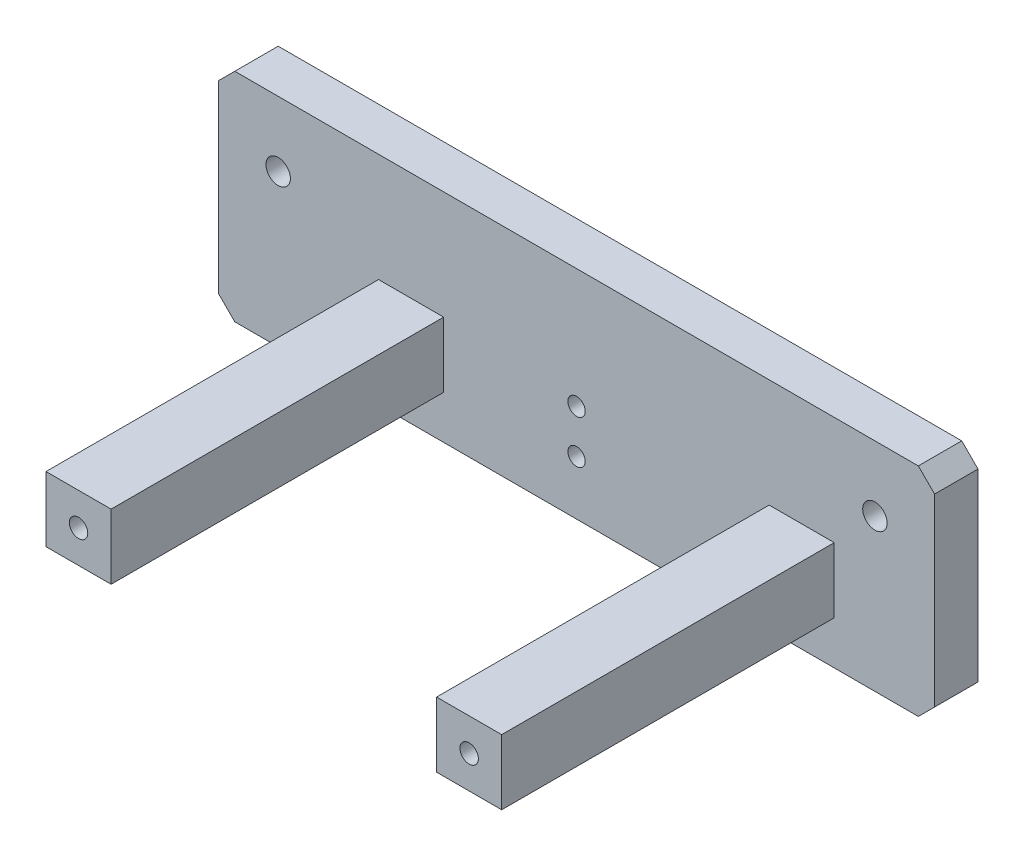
ISO-10303-21;
HEADER;
FILE_DESCRIPTION(('STEP AP214'),'2;1');
FILE_NAME('part.step','',(''),(''),'','','');
FILE_SCHEMA(('AUTOMOTIVE_DESIGN { 1 0 10303 214 1 1 1 1 }'));
ENDSEC;
DATA;
#1=APPLICATION_CONTEXT('core data for automotive mechanical design processes');
#2=APPLICATION_PROTOCOL_DEFINITION('international standard','automotive_design',2000,#1);
#3=PRODUCT_CONTEXT('',#1,'mechanical');
#4=PRODUCT('Part','Part','',(#3));
#5=PRODUCT_RELATED_PRODUCT_CATEGORY('part','',(#4));
#6=PRODUCT_DEFINITION_FORMATION('','',#4);
#7=PRODUCT_DEFINITION_CONTEXT('part definition',#1,'design');
#8=PRODUCT_DEFINITION('design','',#6,#7);
#9=PRODUCT_DEFINITION_SHAPE('','',#8);
#10=(LENGTH_UNIT() NAMED_UNIT(*) SI_UNIT(.MILLI.,.METRE.));
#11=(NAMED_UNIT(*) PLANE_ANGLE_UNIT() SI_UNIT($,.RADIAN.));
#12=(NAMED_UNIT(*) SI_UNIT($,.STERADIAN.) SOLID_ANGLE_UNIT());
#13=UNCERTAINTY_MEASURE_WITH_UNIT(LENGTH_MEASURE(1.E-05),#10,'distance_accuracy_value','');
#14=(GEOMETRIC_REPRESENTATION_CONTEXT(3) GLOBAL_UNCERTAINTY_ASSIGNED_CONTEXT((#13)) GLOBAL_UNIT_ASSIGNED_CONTEXT((#10,
#11,#12)) REPRESENTATION_CONTEXT('',''));
#15=CARTESIAN_POINT('',(0.,0.,0.));
#16=DIRECTION('',(0.,0.,1.));
#17=DIRECTION('',(1.,0.,0.));
#18=AXIS2_PLACEMENT_3D('',#15,#16,#17);
#19=CARTESIAN_POINT('',(0.,0.,8.));
#20=DIRECTION('',(0.,0.,1.));
#21=DIRECTION('',(1.,0.,0.));
#22=AXIS2_PLACEMENT_3D('',#19,#20,#21);
#23=PLANE('',#22);
#24=DIRECTION('',(1.,0.,0.));
#25=VECTOR('',#24,1.);
#26=CARTESIAN_POINT('',(35.5,-12.,8.));
#27=LINE('',#26,#25);
#28=CARTESIAN_POINT('',(35.5,-12.,8.));
#29=VERTEX_POINT('',#28);
#30=CARTESIAN_POINT('',(47.5,-12.,8.));
#31=VERTEX_POINT('',#30);
#32=EDGE_CURVE('E206',#29,#31,#27,.T.);
#33=ORIENTED_EDGE('',*,*,#32,.F.);
#34=DIRECTION('',(0.,-1.,0.));
#35=VECTOR('',#34,1.);
#36=CARTESIAN_POINT('',(35.5,0.,8.));
#37=LINE('',#36,#35);
#38=CARTESIAN_POINT('',(35.5,0.,8.));
#39=VERTEX_POINT('',#38);
#40=EDGE_CURVE('E208',#39,#29,#37,.T.);
#41=ORIENTED_EDGE('',*,*,#40,.F.);
#42=DIRECTION('',(-1.,0.,0.));
#43=VECTOR('',#42,1.);
#44=CARTESIAN_POINT('',(47.5,0.,8.));
#45=LINE('',#44,#43);
#46=CARTESIAN_POINT('',(47.5,0.,8.));
#47=VERTEX_POINT('',#46);
#48=EDGE_CURVE('E201',#47,#39,#45,.T.);
#49=ORIENTED_EDGE('',*,*,#48,.F.);
#50=DIRECTION('',(0.,1.,0.));
#51=VECTOR('',#50,1.);
#52=CARTESIAN_POINT('',(47.5,-12.,8.));
#53=LINE('',#52,#51);
#54=EDGE_CURVE('E203',#31,#47,#53,.T.);
#55=ORIENTED_EDGE('',*,*,#54,.F.);
#56=EDGE_LOOP('',(#33,#41,#49,#55));
#57=FACE_BOUND('',#56,.T.);
#58=CARTESIAN_POINT('',(0.,-10.,8.));
#59=DIRECTION('',(0.,0.,1.));
#60=DIRECTION('',(1.,0.,0.));
#61=AXIS2_PLACEMENT_3D('',#58,#59,#60);
#62=CIRCLE('',#61,1.6);
#63=CARTESIAN_POINT('',(1.6,-10.,8.));
#64=VERTEX_POINT('',#63);
#65=EDGE_CURVE('E225',#64,#64,#62,.T.);
#66=ORIENTED_EDGE('',*,*,#65,.F.);
#67=EDGE_LOOP('',(#66));
#68=FACE_BOUND('',#67,.T.);
#69=CARTESIAN_POINT('',(-55.,8.,8.));
#70=DIRECTION('',(0.,0.,1.));
#71=DIRECTION('',(1.,0.,0.));
#72=AXIS2_PLACEMENT_3D('',#69,#70,#71);
#73=CIRCLE('',#72,2.25);
#74=CARTESIAN_POINT('',(-52.75,8.,8.));
#75=VERTEX_POINT('',#74);
#76=EDGE_CURVE('E243',#75,#75,#73,.T.);
#77=ORIENTED_EDGE('',*,*,#76,.F.);
#78=EDGE_LOOP('',(#77));
#79=FACE_BOUND('',#78,.T.);
#80=DIRECTION('',(0.707106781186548,-0.707106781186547,0.));
#81=VECTOR('',#80,1.);
#82=CARTESIAN_POINT('',(-66.,-17.,8.));
#83=LINE('',#82,#81);
#84=CARTESIAN_POINT('',(-66.,-17.,8.));
#85=VERTEX_POINT('',#84);
#86=CARTESIAN_POINT('',(-63.,-20.,8.));
#87=VERTEX_POINT('',#86);
#88=EDGE_CURVE('E249',#85,#87,#83,.T.);
#89=ORIENTED_EDGE('',*,*,#88,.T.);
#90=DIRECTION('',(1.,0.,0.));
#91=VECTOR('',#90,1.);
#92=CARTESIAN_POINT('',(-63.,-20.,8.));
#93=LINE('',#92,#91);
#94=CARTESIAN_POINT('',(63.,-20.,8.));
#95=VERTEX_POINT('',#94);
#96=EDGE_CURVE('E252',#87,#95,#93,.T.);
#97=ORIENTED_EDGE('',*,*,#96,.T.);
#98=DIRECTION('',(0.707106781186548,0.707106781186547,0.));
#99=VECTOR('',#98,1.);
#100=CARTESIAN_POINT('',(63.,-20.,8.));
#101=LINE('',#100,#99);
#102=CARTESIAN_POINT('',(66.,-17.,8.));
#103=VERTEX_POINT('',#102);
#104=EDGE_CURVE('E255',#95,#103,#101,.T.);
#105=ORIENTED_EDGE('',*,*,#104,.T.);
#106=DIRECTION('',(0.,1.,0.));
#107=VECTOR('',#106,1.);
#108=CARTESIAN_POINT('',(66.,-17.,8.));
#109=LINE('',#108,#107);
#110=CARTESIAN_POINT('',(66.,17.,8.));
#111=VERTEX_POINT('',#110);
#112=EDGE_CURVE('E257',#103,#111,#109,.T.);
#113=ORIENTED_EDGE('',*,*,#112,.T.);
#114=DIRECTION('',(-0.707106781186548,0.707106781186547,0.));
#115=VECTOR('',#114,1.);
#116=CARTESIAN_POINT('',(66.,17.,8.));
#117=LINE('',#116,#115);
#118=CARTESIAN_POINT('',(63.,20.,8.));
#119=VERTEX_POINT('',#118);
#120=EDGE_CURVE('E259',#111,#119,#117,.T.);
#121=ORIENTED_EDGE('',*,*,#120,.T.);
#122=DIRECTION('',(-1.,0.,0.));
#123=VECTOR('',#122,1.);
#124=CARTESIAN_POINT('',(63.,20.,8.));
#125=LINE('',#124,#123);
#126=CARTESIAN_POINT('',(-63.,20.,8.));
#127=VERTEX_POINT('',#126);
#128=EDGE_CURVE('E261',#119,#127,#125,.T.);
#129=ORIENTED_EDGE('',*,*,#128,.T.);
#130=DIRECTION('',(-0.707106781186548,-0.707106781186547,0.));
#131=VECTOR('',#130,1.);
#132=CARTESIAN_POINT('',(-63.,20.,8.));
#133=LINE('',#132,#131);
#134=CARTESIAN_POINT('',(-66.,17.,8.));
#135=VERTEX_POINT('',#134);
#136=EDGE_CURVE('E263',#127,#135,#133,.T.);
#137=ORIENTED_EDGE('',*,*,#136,.T.);
#138=DIRECTION('',(0.,-1.,0.));
#139=VECTOR('',#138,1.);
#140=CARTESIAN_POINT('',(-66.,17.,8.));
#141=LINE('',#140,#139);
#142=EDGE_CURVE('E265',#135,#85,#141,.T.);
#143=ORIENTED_EDGE('',*,*,#142,.T.);
#144=EDGE_LOOP('',(#89,#97,#105,#113,#121,#129,#137,#143));
#145=FACE_BOUND('',#144,.T.);
#146=CARTESIAN_POINT('',(55.,8.,8.));
#147=DIRECTION('',(0.,0.,1.));
#148=DIRECTION('',(1.,0.,0.));
#149=AXIS2_PLACEMENT_3D('',#146,#147,#148);
#150=CIRCLE('',#149,2.25);
#151=CARTESIAN_POINT('',(57.25,8.,8.));
#152=VERTEX_POINT('',#151);
#153=EDGE_CURVE('E237',#152,#152,#150,.T.);
#154=ORIENTED_EDGE('',*,*,#153,.F.);
#155=EDGE_LOOP('',(#154));
#156=FACE_BOUND('',#155,.T.);
#157=CARTESIAN_POINT('',(0.,-2.,8.));
#158=DIRECTION('',(0.,0.,1.));
#159=DIRECTION('',(1.,0.,0.));
#160=AXIS2_PLACEMENT_3D('',#157,#158,#159);
#161=CIRCLE('',#160,1.6);
#162=CARTESIAN_POINT('',(1.6,-2.,8.));
#163=VERTEX_POINT('',#162);
#164=EDGE_CURVE('E186',#163,#163,#161,.T.);
#165=ORIENTED_EDGE('',*,*,#164,.F.);
#166=EDGE_LOOP('',(#165));
#167=FACE_BOUND('',#166,.T.);
#168=DIRECTION('',(1.,0.,0.));
#169=VECTOR('',#168,1.);
#170=CARTESIAN_POINT('',(-36.5,-12.,8.));
#171=LINE('',#170,#169);
#172=CARTESIAN_POINT('',(-36.5,-12.,8.));
#173=VERTEX_POINT('',#172);
#174=CARTESIAN_POINT('',(-24.5,-12.,8.));
#175=VERTEX_POINT('',#174);
#176=EDGE_CURVE('E417',#173,#175,#171,.T.);
#177=ORIENTED_EDGE('',*,*,#176,.F.);
#178=DIRECTION('',(0.,-1.,0.));
#179=VECTOR('',#178,1.);
#180=CARTESIAN_POINT('',(-36.5,0.,8.));
#181=LINE('',#180,#179);
#182=CARTESIAN_POINT('',(-36.5,0.,8.));
#183=VERTEX_POINT('',#182);
#184=EDGE_CURVE('E181',#183,#173,#181,.T.);
#185=ORIENTED_EDGE('',*,*,#184,.F.);
#186=DIRECTION('',(-1.,0.,0.));
#187=VECTOR('',#186,1.);
#188=CARTESIAN_POINT('',(-24.5,0.,8.));
#189=LINE('',#188,#187);
#190=CARTESIAN_POINT('',(-24.5,0.,8.));
#191=VERTEX_POINT('',#190);
#192=EDGE_CURVE('E177',#191,#183,#189,.T.);
#193=ORIENTED_EDGE('',*,*,#192,.F.);
#194=DIRECTION('',(0.,1.,0.));
#195=VECTOR('',#194,1.);
#196=CARTESIAN_POINT('',(-24.5,-12.,8.));
#197=LINE('',#196,#195);
#198=EDGE_CURVE('E424',#175,#191,#197,.T.);
#199=ORIENTED_EDGE('',*,*,#198,.F.);
#200=EDGE_LOOP('',(#177,#185,#193,#199));
#201=FACE_BOUND('',#200,.T.);
#202=ADVANCED_FACE('F43',(#57,#68,#79,#145,#156,#167,#201),#23,.T.);
#203=CARTESIAN_POINT('',(0.,0.,0.));
#204=DIRECTION('',(0.,0.,1.));
#205=DIRECTION('',(1.,0.,0.));
#206=AXIS2_PLACEMENT_3D('',#203,#204,#205);
#207=PLANE('',#206);
#208=DIRECTION('',(0.707106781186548,-0.707106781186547,0.));
#209=VECTOR('',#208,1.);
#210=CARTESIAN_POINT('',(-66.,-17.,0.));
#211=LINE('',#210,#209);
#212=CARTESIAN_POINT('',(-66.,-17.,0.));
#213=VERTEX_POINT('',#212);
#214=CARTESIAN_POINT('',(-63.,-20.,0.));
#215=VERTEX_POINT('',#214);
#216=EDGE_CURVE('E246',#213,#215,#211,.T.);
#217=ORIENTED_EDGE('',*,*,#216,.F.);
#218=DIRECTION('',(0.,-1.,0.));
#219=VECTOR('',#218,1.);
#220=CARTESIAN_POINT('',(-66.,17.,0.));
#221=LINE('',#220,#219);
#222=CARTESIAN_POINT('',(-66.,17.,0.));
#223=VERTEX_POINT('',#222);
#224=EDGE_CURVE('E253',#223,#213,#221,.T.);
#225=ORIENTED_EDGE('',*,*,#224,.F.);
#226=DIRECTION('',(-0.707106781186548,-0.707106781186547,0.));
#227=VECTOR('',#226,1.);
#228=CARTESIAN_POINT('',(-63.,20.,0.));
#229=LINE('',#228,#227);
#230=CARTESIAN_POINT('',(-63.,20.,0.));
#231=VERTEX_POINT('',#230);
#232=EDGE_CURVE('E280',#231,#223,#229,.T.);
#233=ORIENTED_EDGE('',*,*,#232,.F.);
#234=DIRECTION('',(-1.,0.,0.));
#235=VECTOR('',#234,1.);
#236=CARTESIAN_POINT('',(63.,20.,0.));
#237=LINE('',#236,#235);
#238=CARTESIAN_POINT('',(63.,20.,0.));
#239=VERTEX_POINT('',#238);
#240=EDGE_CURVE('E278',#239,#231,#237,.T.);
#241=ORIENTED_EDGE('',*,*,#240,.F.);
#242=DIRECTION('',(-0.707106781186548,0.707106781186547,0.));
#243=VECTOR('',#242,1.);
#244=CARTESIAN_POINT('',(66.,17.,0.));
#245=LINE('',#244,#243);
#246=CARTESIAN_POINT('',(66.,17.,0.));
#247=VERTEX_POINT('',#246);
#248=EDGE_CURVE('E276',#247,#239,#245,.T.);
#249=ORIENTED_EDGE('',*,*,#248,.F.);
#250=DIRECTION('',(0.,1.,0.));
#251=VECTOR('',#250,1.);
#252=CARTESIAN_POINT('',(66.,-17.,0.));
#253=LINE('',#252,#251);
#254=CARTESIAN_POINT('',(66.,-17.,0.));
#255=VERTEX_POINT('',#254);
#256=EDGE_CURVE('E274',#255,#247,#253,.T.);
#257=ORIENTED_EDGE('',*,*,#256,.F.);
#258=DIRECTION('',(0.707106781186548,0.707106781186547,0.));
#259=VECTOR('',#258,1.);
#260=CARTESIAN_POINT('',(63.,-20.,0.));
#261=LINE('',#260,#259);
#262=CARTESIAN_POINT('',(63.,-20.,0.));
#263=VERTEX_POINT('',#262);
#264=EDGE_CURVE('E272',#263,#255,#261,.T.);
#265=ORIENTED_EDGE('',*,*,#264,.F.);
#266=DIRECTION('',(1.,0.,0.));
#267=VECTOR('',#266,1.);
#268=CARTESIAN_POINT('',(-63.,-20.,0.));
#269=LINE('',#268,#267);
#270=EDGE_CURVE('E270',#215,#263,#269,.T.);
#271=ORIENTED_EDGE('',*,*,#270,.F.);
#272=EDGE_LOOP('',(#217,#225,#233,#241,#249,#257,#265,#271));
#273=FACE_BOUND('',#272,.T.);
#274=CARTESIAN_POINT('',(-55.,8.,0.));
#275=DIRECTION('',(0.,0.,1.));
#276=DIRECTION('',(1.,0.,0.));
#277=AXIS2_PLACEMENT_3D('',#274,#275,#276);
#278=CIRCLE('',#277,2.25);
#279=CARTESIAN_POINT('',(-52.75,8.,0.));
#280=VERTEX_POINT('',#279);
#281=EDGE_CURVE('E240',#280,#280,#278,.T.);
#282=ORIENTED_EDGE('',*,*,#281,.T.);
#283=EDGE_LOOP('',(#282));
#284=FACE_BOUND('',#283,.T.);
#285=CARTESIAN_POINT('',(55.,8.,0.));
#286=DIRECTION('',(0.,0.,1.));
#287=DIRECTION('',(1.,0.,0.));
#288=AXIS2_PLACEMENT_3D('',#285,#286,#287);
#289=CIRCLE('',#288,2.25);
#290=CARTESIAN_POINT('',(57.25,8.,0.));
#291=VERTEX_POINT('',#290);
#292=EDGE_CURVE('E236',#291,#291,#289,.T.);
#293=ORIENTED_EDGE('',*,*,#292,.T.);
#294=EDGE_LOOP('',(#293));
#295=FACE_BOUND('',#294,.T.);
#296=CARTESIAN_POINT('',(-30.5,-6.,0.));
#297=DIRECTION('',(0.,0.,1.));
#298=DIRECTION('',(1.,0.,0.));
#299=AXIS2_PLACEMENT_3D('',#296,#297,#298);
#300=CIRCLE('',#299,1.7);
#301=CARTESIAN_POINT('',(-28.8,-6.,0.));
#302=VERTEX_POINT('',#301);
#303=EDGE_CURVE('E233',#302,#302,#300,.T.);
#304=ORIENTED_EDGE('',*,*,#303,.T.);
#305=EDGE_LOOP('',(#304));
#306=FACE_BOUND('',#305,.T.);
#307=CARTESIAN_POINT('',(41.5,-6.,0.));
#308=DIRECTION('',(0.,0.,1.));
#309=DIRECTION('',(1.,0.,0.));
#310=AXIS2_PLACEMENT_3D('',#307,#308,#309);
#311=CIRCLE('',#310,1.7);
#312=CARTESIAN_POINT('',(43.2,-6.,0.));
#313=VERTEX_POINT('',#312);
#314=EDGE_CURVE('E228',#313,#313,#311,.T.);
#315=ORIENTED_EDGE('',*,*,#314,.T.);
#316=EDGE_LOOP('',(#315));
#317=FACE_BOUND('',#316,.T.);
#318=CARTESIAN_POINT('',(0.,-10.,0.));
#319=DIRECTION('',(0.,0.,1.));
#320=DIRECTION('',(1.,0.,0.));
#321=AXIS2_PLACEMENT_3D('',#318,#319,#320);
#322=CIRCLE('',#321,1.6);
#323=CARTESIAN_POINT('',(1.6,-10.,0.));
#324=VERTEX_POINT('',#323);
#325=EDGE_CURVE('E223',#324,#324,#322,.T.);
#326=ORIENTED_EDGE('',*,*,#325,.T.);
#327=EDGE_LOOP('',(#326));
#328=FACE_BOUND('',#327,.T.);
#329=CARTESIAN_POINT('',(0.,-2.,0.));
#330=DIRECTION('',(0.,0.,1.));
#331=DIRECTION('',(1.,0.,0.));
#332=AXIS2_PLACEMENT_3D('',#329,#330,#331);
#333=CIRCLE('',#332,1.6);
#334=CARTESIAN_POINT('',(1.6,-2.,0.));
#335=VERTEX_POINT('',#334);
#336=EDGE_CURVE('E183',#335,#335,#333,.T.);
#337=ORIENTED_EDGE('',*,*,#336,.T.);
#338=EDGE_LOOP('',(#337));
#339=FACE_BOUND('',#338,.T.);
#340=ADVANCED_FACE('F310',(#273,#284,#295,#306,#317,#328,#339),#207,.F.);
#341=CARTESIAN_POINT('',(-66.,-17.,8.));
#342=DIRECTION('',(0.707106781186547,0.707106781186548,0.));
#343=DIRECTION('',(-0.707106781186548,0.707106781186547,0.));
#344=AXIS2_PLACEMENT_3D('',#341,#342,#343);
#345=PLANE('',#344);
#346=ORIENTED_EDGE('',*,*,#216,.T.);
#347=DIRECTION('',(0.,0.,-1.));
#348=VECTOR('',#347,1.);
#349=CARTESIAN_POINT('',(-63.,-20.,8.));
#350=LINE('',#349,#348);
#351=EDGE_CURVE('E11',#87,#215,#350,.T.);
#352=ORIENTED_EDGE('',*,*,#351,.F.);
#353=ORIENTED_EDGE('',*,*,#88,.F.);
#354=DIRECTION('',(0.,0.,-1.));
#355=VECTOR('',#354,1.);
#356=CARTESIAN_POINT('',(-66.,-17.,8.));
#357=LINE('',#356,#355);
#358=EDGE_CURVE('E267',#85,#213,#357,.T.);
#359=ORIENTED_EDGE('',*,*,#358,.T.);
#360=EDGE_LOOP('',(#346,#352,#353,#359));
#361=FACE_BOUND('',#360,.T.);
#362=ADVANCED_FACE('F45',(#361),#345,.F.);
#363=CARTESIAN_POINT('',(-63.,-20.,8.));
#364=DIRECTION('',(0.,1.,0.));
#365=DIRECTION('',(0.,0.,1.));
#366=AXIS2_PLACEMENT_3D('',#363,#364,#365);
#367=PLANE('',#366);
#368=ORIENTED_EDGE('',*,*,#270,.T.);
#369=DIRECTION('',(0.,0.,-1.));
#370=VECTOR('',#369,1.);
#371=CARTESIAN_POINT('',(63.,-20.,8.));
#372=LINE('',#371,#370);
#373=EDGE_CURVE('E51',#95,#263,#372,.T.);
#374=ORIENTED_EDGE('',*,*,#373,.F.);
#375=ORIENTED_EDGE('',*,*,#96,.F.);
#376=ORIENTED_EDGE('',*,*,#351,.T.);
#377=EDGE_LOOP('',(#368,#374,#375,#376));
#378=FACE_BOUND('',#377,.T.);
#379=ADVANCED_FACE('F328',(#378),#367,.F.);
#380=CARTESIAN_POINT('',(63.,-20.,8.));
#381=DIRECTION('',(-0.707106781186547,0.707106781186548,0.));
#382=DIRECTION('',(-0.707106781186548,-0.707106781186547,0.));
#383=AXIS2_PLACEMENT_3D('',#380,#381,#382);
#384=PLANE('',#383);
#385=ORIENTED_EDGE('',*,*,#264,.T.);
#386=DIRECTION('',(0.,0.,-1.));
#387=VECTOR('',#386,1.);
#388=CARTESIAN_POINT('',(66.,-17.,8.));
#389=LINE('',#388,#387);
#390=EDGE_CURVE('E297',#103,#255,#389,.T.);
#391=ORIENTED_EDGE('',*,*,#390,.F.);
#392=ORIENTED_EDGE('',*,*,#104,.F.);
#393=ORIENTED_EDGE('',*,*,#373,.T.);
#394=EDGE_LOOP('',(#385,#391,#392,#393));
#395=FACE_BOUND('',#394,.T.);
#396=ADVANCED_FACE('F304',(#395),#384,.F.);
#397=CARTESIAN_POINT('',(66.,-17.,8.));
#398=DIRECTION('',(-1.,0.,0.));
#399=DIRECTION('',(0.,0.,1.));
#400=AXIS2_PLACEMENT_3D('',#397,#398,#399);
#401=PLANE('',#400);
#402=ORIENTED_EDGE('',*,*,#256,.T.);
#403=DIRECTION('',(0.,0.,-1.));
#404=VECTOR('',#403,1.);
#405=CARTESIAN_POINT('',(66.,17.,8.));
#406=LINE('',#405,#404);
#407=EDGE_CURVE('E294',#111,#247,#406,.T.);
#408=ORIENTED_EDGE('',*,*,#407,.F.);
#409=ORIENTED_EDGE('',*,*,#112,.F.);
#410=ORIENTED_EDGE('',*,*,#390,.T.);
#411=EDGE_LOOP('',(#402,#408,#409,#410));
#412=FACE_BOUND('',#411,.T.);
#413=ADVANCED_FACE('F316',(#412),#401,.F.);
#414=CARTESIAN_POINT('',(66.,17.,8.));
#415=DIRECTION('',(-0.707106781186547,-0.707106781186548,0.));
#416=DIRECTION('',(0.707106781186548,-0.707106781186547,0.));
#417=AXIS2_PLACEMENT_3D('',#414,#415,#416);
#418=PLANE('',#417);
#419=ORIENTED_EDGE('',*,*,#248,.T.);
#420=DIRECTION('',(0.,0.,-1.));
#421=VECTOR('',#420,1.);
#422=CARTESIAN_POINT('',(63.,20.,8.));
#423=LINE('',#422,#421);
#424=EDGE_CURVE('E291',#119,#239,#423,.T.);
#425=ORIENTED_EDGE('',*,*,#424,.F.);
#426=ORIENTED_EDGE('',*,*,#120,.F.);
#427=ORIENTED_EDGE('',*,*,#407,.T.);
#428=EDGE_LOOP('',(#419,#425,#426,#427));
#429=FACE_BOUND('',#428,.T.);
#430=ADVANCED_FACE('F320',(#429),#418,.F.);
#431=CARTESIAN_POINT('',(63.,20.,8.));
#432=DIRECTION('',(0.,-1.,0.));
#433=DIRECTION('',(0.,0.,-1.));
#434=AXIS2_PLACEMENT_3D('',#431,#432,#433);
#435=PLANE('',#434);
#436=ORIENTED_EDGE('',*,*,#240,.T.);
#437=DIRECTION('',(0.,0.,-1.));
#438=VECTOR('',#437,1.);
#439=CARTESIAN_POINT('',(-63.,20.,8.));
#440=LINE('',#439,#438);
#441=EDGE_CURVE('E288',#127,#231,#440,.T.);
#442=ORIENTED_EDGE('',*,*,#441,.F.);
#443=ORIENTED_EDGE('',*,*,#128,.F.);
#444=ORIENTED_EDGE('',*,*,#424,.T.);
#445=EDGE_LOOP('',(#436,#442,#443,#444));
#446=FACE_BOUND('',#445,.T.);
#447=ADVANCED_FACE('F341',(#446),#435,.F.);
#448=CARTESIAN_POINT('',(-63.,20.,8.));
#449=DIRECTION('',(0.707106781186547,-0.707106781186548,0.));
#450=DIRECTION('',(0.707106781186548,0.707106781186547,0.));
#451=AXIS2_PLACEMENT_3D('',#448,#449,#450);
#452=PLANE('',#451);
#453=ORIENTED_EDGE('',*,*,#232,.T.);
#454=DIRECTION('',(0.,0.,-1.));
#455=VECTOR('',#454,1.);
#456=CARTESIAN_POINT('',(-66.,17.,8.));
#457=LINE('',#456,#455);
#458=EDGE_CURVE('E285',#135,#223,#457,.T.);
#459=ORIENTED_EDGE('',*,*,#458,.F.);
#460=ORIENTED_EDGE('',*,*,#136,.F.);
#461=ORIENTED_EDGE('',*,*,#441,.T.);
#462=EDGE_LOOP('',(#453,#459,#460,#461));
#463=FACE_BOUND('',#462,.T.);
#464=ADVANCED_FACE('F339',(#463),#452,.F.);
#465=CARTESIAN_POINT('',(-66.,17.,8.));
#466=DIRECTION('',(1.,0.,0.));
#467=DIRECTION('',(0.,0.,-1.));
#468=AXIS2_PLACEMENT_3D('',#465,#466,#467);
#469=PLANE('',#468);
#470=ORIENTED_EDGE('',*,*,#224,.T.);
#471=ORIENTED_EDGE('',*,*,#358,.F.);
#472=ORIENTED_EDGE('',*,*,#142,.F.);
#473=ORIENTED_EDGE('',*,*,#458,.T.);
#474=EDGE_LOOP('',(#470,#471,#472,#473));
#475=FACE_BOUND('',#474,.T.);
#476=ADVANCED_FACE('F334',(#475),#469,.F.);
#477=CARTESIAN_POINT('',(-55.,8.,8.));
#478=DIRECTION('',(0.,0.,-1.));
#479=DIRECTION('',(-1.,0.,0.));
#480=AXIS2_PLACEMENT_3D('',#477,#478,#479);
#481=CYLINDRICAL_SURFACE('',#480,2.25);
#482=ORIENTED_EDGE('',*,*,#76,.T.);
#483=EDGE_LOOP('',(#482));
#484=FACE_BOUND('',#483,.T.);
#485=ORIENTED_EDGE('',*,*,#281,.F.);
#486=EDGE_LOOP('',(#485));
#487=FACE_BOUND('',#486,.T.);
#488=ADVANCED_FACE('F362',(#484,#487),#481,.F.);
#489=CARTESIAN_POINT('',(55.,8.,8.));
#490=DIRECTION('',(0.,0.,-1.));
#491=DIRECTION('',(-1.,0.,0.));
#492=AXIS2_PLACEMENT_3D('',#489,#490,#491);
#493=CYLINDRICAL_SURFACE('',#492,2.25);
#494=ORIENTED_EDGE('',*,*,#153,.T.);
#495=EDGE_LOOP('',(#494));
#496=FACE_BOUND('',#495,.T.);
#497=ORIENTED_EDGE('',*,*,#292,.F.);
#498=EDGE_LOOP('',(#497));
#499=FACE_BOUND('',#498,.T.);
#500=ADVANCED_FACE('F369',(#496,#499),#493,.F.);
#501=CARTESIAN_POINT('',(-30.5,-6.,8.));
#502=DIRECTION('',(0.,0.,-1.));
#503=DIRECTION('',(-1.,0.,0.));
#504=AXIS2_PLACEMENT_3D('',#501,#502,#503);
#505=CYLINDRICAL_SURFACE('',#504,1.7);
#506=ORIENTED_EDGE('',*,*,#303,.F.);
#507=EDGE_LOOP('',(#506));
#508=FACE_BOUND('',#507,.T.);
#509=CARTESIAN_POINT('',(-30.5,-6.,69.3));
#510=DIRECTION('',(0.,0.,1.));
#511=DIRECTION('',(1.,0.,0.));
#512=AXIS2_PLACEMENT_3D('',#509,#510,#511);
#513=CIRCLE('',#512,1.7);
#514=CARTESIAN_POINT('',(-28.8,-6.,69.3));
#515=VERTEX_POINT('',#514);
#516=EDGE_CURVE('E221',#515,#515,#513,.T.);
#517=ORIENTED_EDGE('',*,*,#516,.T.);
#518=EDGE_LOOP('',(#517));
#519=FACE_BOUND('',#518,.T.);
#520=ADVANCED_FACE('F374',(#508,#519),#505,.F.);
#521=CARTESIAN_POINT('',(41.5,-6.,8.));
#522=DIRECTION('',(0.,0.,-1.));
#523=DIRECTION('',(-1.,0.,0.));
#524=AXIS2_PLACEMENT_3D('',#521,#522,#523);
#525=CYLINDRICAL_SURFACE('',#524,1.7);
#526=ORIENTED_EDGE('',*,*,#314,.F.);
#527=EDGE_LOOP('',(#526));
#528=FACE_BOUND('',#527,.T.);
#529=CARTESIAN_POINT('',(41.5,-6.,69.3));
#530=DIRECTION('',(0.,0.,1.));
#531=DIRECTION('',(1.,0.,0.));
#532=AXIS2_PLACEMENT_3D('',#529,#530,#531);
#533=CIRCLE('',#532,1.7);
#534=CARTESIAN_POINT('',(43.2,-6.,69.3));
#535=VERTEX_POINT('',#534);
#536=EDGE_CURVE('E211',#535,#535,#533,.T.);
#537=ORIENTED_EDGE('',*,*,#536,.T.);
#538=EDGE_LOOP('',(#537));
#539=FACE_BOUND('',#538,.T.);
#540=ADVANCED_FACE('F402',(#528,#539),#525,.F.);
#541=CARTESIAN_POINT('',(0.,-10.,8.));
#542=DIRECTION('',(0.,0.,-1.));
#543=DIRECTION('',(-1.,0.,0.));
#544=AXIS2_PLACEMENT_3D('',#541,#542,#543);
#545=CYLINDRICAL_SURFACE('',#544,1.6);
#546=ORIENTED_EDGE('',*,*,#65,.T.);
#547=EDGE_LOOP('',(#546));
#548=FACE_BOUND('',#547,.T.);
#549=ORIENTED_EDGE('',*,*,#325,.F.);
#550=EDGE_LOOP('',(#549));
#551=FACE_BOUND('',#550,.T.);
#552=ADVANCED_FACE('F392',(#548,#551),#545,.F.);
#553=CARTESIAN_POINT('',(0.,-2.,8.));
#554=DIRECTION('',(0.,0.,-1.));
#555=DIRECTION('',(-1.,0.,0.));
#556=AXIS2_PLACEMENT_3D('',#553,#554,#555);
#557=CYLINDRICAL_SURFACE('',#556,1.6);
#558=ORIENTED_EDGE('',*,*,#164,.T.);
#559=EDGE_LOOP('',(#558));
#560=FACE_BOUND('',#559,.T.);
#561=ORIENTED_EDGE('',*,*,#336,.F.);
#562=EDGE_LOOP('',(#561));
#563=FACE_BOUND('',#562,.T.);
#564=ADVANCED_FACE('F390',(#560,#563),#557,.F.);
#565=CARTESIAN_POINT('',(0.,0.,69.3));
#566=DIRECTION('',(0.,0.,1.));
#567=DIRECTION('',(1.,0.,0.));
#568=AXIS2_PLACEMENT_3D('',#565,#566,#567);
#569=PLANE('',#568);
#570=DIRECTION('',(0.,-1.,0.));
#571=VECTOR('',#570,1.);
#572=CARTESIAN_POINT('',(35.5,0.,69.3));
#573=LINE('',#572,#571);
#574=CARTESIAN_POINT('',(35.5,0.,69.3));
#575=VERTEX_POINT('',#574);
#576=CARTESIAN_POINT('',(35.5,-12.,69.3));
#577=VERTEX_POINT('',#576);
#578=EDGE_CURVE('E204',#575,#577,#573,.T.);
#579=ORIENTED_EDGE('',*,*,#578,.T.);
#580=DIRECTION('',(1.,0.,0.));
#581=VECTOR('',#580,1.);
#582=CARTESIAN_POINT('',(35.5,-12.,69.3));
#583=LINE('',#582,#581);
#584=CARTESIAN_POINT('',(47.5,-12.,69.3));
#585=VERTEX_POINT('',#584);
#586=EDGE_CURVE('E215',#577,#585,#583,.T.);
#587=ORIENTED_EDGE('',*,*,#586,.T.);
#588=DIRECTION('',(0.,1.,0.));
#589=VECTOR('',#588,1.);
#590=CARTESIAN_POINT('',(47.5,-12.,69.3));
#591=LINE('',#590,#589);
#592=CARTESIAN_POINT('',(47.5,0.,69.3));
#593=VERTEX_POINT('',#592);
#594=EDGE_CURVE('E213',#585,#593,#591,.T.);
#595=ORIENTED_EDGE('',*,*,#594,.T.);
#596=DIRECTION('',(-1.,0.,0.));
#597=VECTOR('',#596,1.);
#598=CARTESIAN_POINT('',(47.5,0.,69.3));
#599=LINE('',#598,#597);
#600=EDGE_CURVE('E200',#593,#575,#599,.T.);
#601=ORIENTED_EDGE('',*,*,#600,.T.);
#602=EDGE_LOOP('',(#579,#587,#595,#601));
#603=FACE_BOUND('',#602,.T.);
#604=ORIENTED_EDGE('',*,*,#536,.F.);
#605=EDGE_LOOP('',(#604));
#606=FACE_BOUND('',#605,.T.);
#607=ADVANCED_FACE('F391',(#603,#606),#569,.T.);
#608=CARTESIAN_POINT('',(35.5,0.,69.3));
#609=DIRECTION('',(1.,0.,0.));
#610=DIRECTION('',(0.,0.,-1.));
#611=AXIS2_PLACEMENT_3D('',#608,#609,#610);
#612=PLANE('',#611);
#613=ORIENTED_EDGE('',*,*,#40,.T.);
#614=DIRECTION('',(0.,0.,-1.));
#615=VECTOR('',#614,1.);
#616=CARTESIAN_POINT('',(35.5,-12.,69.3));
#617=LINE('',#616,#615);
#618=EDGE_CURVE('E191',#577,#29,#617,.T.);
#619=ORIENTED_EDGE('',*,*,#618,.F.);
#620=ORIENTED_EDGE('',*,*,#578,.F.);
#621=DIRECTION('',(0.,0.,-1.));
#622=VECTOR('',#621,1.);
#623=CARTESIAN_POINT('',(35.5,0.,69.3));
#624=LINE('',#623,#622);
#625=EDGE_CURVE('E197',#575,#39,#624,.T.);
#626=ORIENTED_EDGE('',*,*,#625,.T.);
#627=EDGE_LOOP('',(#613,#619,#620,#626));
#628=FACE_BOUND('',#627,.T.);
#629=ADVANCED_FACE('F399',(#628),#612,.F.);
#630=CARTESIAN_POINT('',(35.5,-12.,69.3));
#631=DIRECTION('',(0.,1.,0.));
#632=DIRECTION('',(0.,0.,1.));
#633=AXIS2_PLACEMENT_3D('',#630,#631,#632);
#634=PLANE('',#633);
#635=ORIENTED_EDGE('',*,*,#32,.T.);
#636=DIRECTION('',(0.,0.,-1.));
#637=VECTOR('',#636,1.);
#638=CARTESIAN_POINT('',(47.5,-12.,69.3));
#639=LINE('',#638,#637);
#640=EDGE_CURVE('E193',#585,#31,#639,.T.);
#641=ORIENTED_EDGE('',*,*,#640,.F.);
#642=ORIENTED_EDGE('',*,*,#586,.F.);
#643=ORIENTED_EDGE('',*,*,#618,.T.);
#644=EDGE_LOOP('',(#635,#641,#642,#643));
#645=FACE_BOUND('',#644,.T.);
#646=ADVANCED_FACE('F447',(#645),#634,.F.);
#647=CARTESIAN_POINT('',(47.5,-12.,69.3));
#648=DIRECTION('',(-1.,0.,0.));
#649=DIRECTION('',(0.,0.,1.));
#650=AXIS2_PLACEMENT_3D('',#647,#648,#649);
#651=PLANE('',#650);
#652=ORIENTED_EDGE('',*,*,#54,.T.);
#653=DIRECTION('',(0.,0.,-1.));
#654=VECTOR('',#653,1.);
#655=CARTESIAN_POINT('',(47.5,0.,69.3));
#656=LINE('',#655,#654);
#657=EDGE_CURVE('E66',#593,#47,#656,.T.);
#658=ORIENTED_EDGE('',*,*,#657,.F.);
#659=ORIENTED_EDGE('',*,*,#594,.F.);
#660=ORIENTED_EDGE('',*,*,#640,.T.);
#661=EDGE_LOOP('',(#652,#658,#659,#660));
#662=FACE_BOUND('',#661,.T.);
#663=ADVANCED_FACE('F451',(#662),#651,.F.);
#664=CARTESIAN_POINT('',(47.5,0.,69.3));
#665=DIRECTION('',(0.,-1.,0.));
#666=DIRECTION('',(0.,0.,-1.));
#667=AXIS2_PLACEMENT_3D('',#664,#665,#666);
#668=PLANE('',#667);
#669=ORIENTED_EDGE('',*,*,#48,.T.);
#670=ORIENTED_EDGE('',*,*,#625,.F.);
#671=ORIENTED_EDGE('',*,*,#600,.F.);
#672=ORIENTED_EDGE('',*,*,#657,.T.);
#673=EDGE_LOOP('',(#669,#670,#671,#672));
#674=FACE_BOUND('',#673,.T.);
#675=ADVANCED_FACE('F454',(#674),#668,.F.);
#676=CARTESIAN_POINT('',(0.,0.,69.3));
#677=DIRECTION('',(0.,0.,1.));
#678=DIRECTION('',(1.,0.,0.));
#679=AXIS2_PLACEMENT_3D('',#676,#677,#678);
#680=PLANE('',#679);
#681=DIRECTION('',(0.,-1.,0.));
#682=VECTOR('',#681,1.);
#683=CARTESIAN_POINT('',(-36.5,0.,69.3));
#684=LINE('',#683,#682);
#685=CARTESIAN_POINT('',(-36.5,0.,69.3));
#686=VERTEX_POINT('',#685);
#687=CARTESIAN_POINT('',(-36.5,-12.,69.3));
#688=VERTEX_POINT('',#687);
#689=EDGE_CURVE('E168',#686,#688,#684,.T.);
#690=ORIENTED_EDGE('',*,*,#689,.T.);
#691=DIRECTION('',(1.,0.,0.));
#692=VECTOR('',#691,1.);
#693=CARTESIAN_POINT('',(-36.5,-12.,69.3));
#694=LINE('',#693,#692);
#695=CARTESIAN_POINT('',(-24.5,-12.,69.3));
#696=VERTEX_POINT('',#695);
#697=EDGE_CURVE('E157',#688,#696,#694,.T.);
#698=ORIENTED_EDGE('',*,*,#697,.T.);
#699=DIRECTION('',(0.,1.,0.));
#700=VECTOR('',#699,1.);
#701=CARTESIAN_POINT('',(-24.5,-12.,69.3));
#702=LINE('',#701,#700);
#703=CARTESIAN_POINT('',(-24.5,0.,69.3));
#704=VERTEX_POINT('',#703);
#705=EDGE_CURVE('E167',#696,#704,#702,.T.);
#706=ORIENTED_EDGE('',*,*,#705,.T.);
#707=DIRECTION('',(-1.,0.,0.));
#708=VECTOR('',#707,1.);
#709=CARTESIAN_POINT('',(-24.5,0.,69.3));
#710=LINE('',#709,#708);
#711=EDGE_CURVE('E173',#704,#686,#710,.T.);
#712=ORIENTED_EDGE('',*,*,#711,.T.);
#713=EDGE_LOOP('',(#690,#698,#706,#712));
#714=FACE_BOUND('',#713,.T.);
#715=ORIENTED_EDGE('',*,*,#516,.F.);
#716=EDGE_LOOP('',(#715));
#717=FACE_BOUND('',#716,.T.);
#718=ADVANCED_FACE('F171',(#714,#717),#680,.T.);
#719=CARTESIAN_POINT('',(-36.5,0.,69.3));
#720=DIRECTION('',(1.,0.,0.));
#721=DIRECTION('',(0.,0.,-1.));
#722=AXIS2_PLACEMENT_3D('',#719,#720,#721);
#723=PLANE('',#722);
#724=ORIENTED_EDGE('',*,*,#184,.T.);
#725=DIRECTION('',(0.,0.,-1.));
#726=VECTOR('',#725,1.);
#727=CARTESIAN_POINT('',(-36.5,-12.,69.3));
#728=LINE('',#727,#726);
#729=EDGE_CURVE('E161',#688,#173,#728,.T.);
#730=ORIENTED_EDGE('',*,*,#729,.F.);
#731=ORIENTED_EDGE('',*,*,#689,.F.);
#732=DIRECTION('',(0.,0.,-1.));
#733=VECTOR('',#732,1.);
#734=CARTESIAN_POINT('',(-36.5,0.,69.3));
#735=LINE('',#734,#733);
#736=EDGE_CURVE('E421',#686,#183,#735,.T.);
#737=ORIENTED_EDGE('',*,*,#736,.T.);
#738=EDGE_LOOP('',(#724,#730,#731,#737));
#739=FACE_BOUND('',#738,.T.);
#740=ADVANCED_FACE('F179',(#739),#723,.F.);
#741=CARTESIAN_POINT('',(-36.5,-12.,69.3));
#742=DIRECTION('',(0.,1.,0.));
#743=DIRECTION('',(0.,0.,1.));
#744=AXIS2_PLACEMENT_3D('',#741,#742,#743);
#745=PLANE('',#744);
#746=ORIENTED_EDGE('',*,*,#176,.T.);
#747=DIRECTION('',(0.,0.,-1.));
#748=VECTOR('',#747,1.);
#749=CARTESIAN_POINT('',(-24.5,-12.,69.3));
#750=LINE('',#749,#748);
#751=EDGE_CURVE('E164',#696,#175,#750,.T.);
#752=ORIENTED_EDGE('',*,*,#751,.F.);
#753=ORIENTED_EDGE('',*,*,#697,.F.);
#754=ORIENTED_EDGE('',*,*,#729,.T.);
#755=EDGE_LOOP('',(#746,#752,#753,#754));
#756=FACE_BOUND('',#755,.T.);
#757=ADVANCED_FACE('F159',(#756),#745,.F.);
#758=CARTESIAN_POINT('',(-24.5,-12.,69.3));
#759=DIRECTION('',(-1.,0.,0.));
#760=DIRECTION('',(0.,0.,1.));
#761=AXIS2_PLACEMENT_3D('',#758,#759,#760);
#762=PLANE('',#761);
#763=ORIENTED_EDGE('',*,*,#198,.T.);
#764=DIRECTION('',(0.,0.,-1.));
#765=VECTOR('',#764,1.);
#766=CARTESIAN_POINT('',(-24.5,0.,69.3));
#767=LINE('',#766,#765);
#768=EDGE_CURVE('E58',#704,#191,#767,.T.);
#769=ORIENTED_EDGE('',*,*,#768,.F.);
#770=ORIENTED_EDGE('',*,*,#705,.F.);
#771=ORIENTED_EDGE('',*,*,#751,.T.);
#772=EDGE_LOOP('',(#763,#769,#770,#771));
#773=FACE_BOUND('',#772,.T.);
#774=ADVANCED_FACE('F431',(#773),#762,.F.);
#775=CARTESIAN_POINT('',(-24.5,0.,69.3));
#776=DIRECTION('',(0.,-1.,0.));
#777=DIRECTION('',(0.,0.,-1.));
#778=AXIS2_PLACEMENT_3D('',#775,#776,#777);
#779=PLANE('',#778);
#780=ORIENTED_EDGE('',*,*,#192,.T.);
#781=ORIENTED_EDGE('',*,*,#736,.F.);
#782=ORIENTED_EDGE('',*,*,#711,.F.);
#783=ORIENTED_EDGE('',*,*,#768,.T.);
#784=EDGE_LOOP('',(#780,#781,#782,#783));
#785=FACE_BOUND('',#784,.T.);
#786=ADVANCED_FACE('F432',(#785),#779,.F.);
#787=CLOSED_SHELL('',(#202,#340,#362,#379,#396,#413,#430,#447,#464,#476,#488,#500,#520,#540,
#552,#564,#607,#629,#646,#663,#675,#718,#740,#757,#774,#786));
#788=MANIFOLD_SOLID_BREP('B2',#787);
#789=ADVANCED_BREP_SHAPE_REPRESENTATION('',(#18,#788),#14);
#790=SHAPE_DEFINITION_REPRESENTATION(#9,#789);
ENDSEC;
END-ISO-10303-21;
